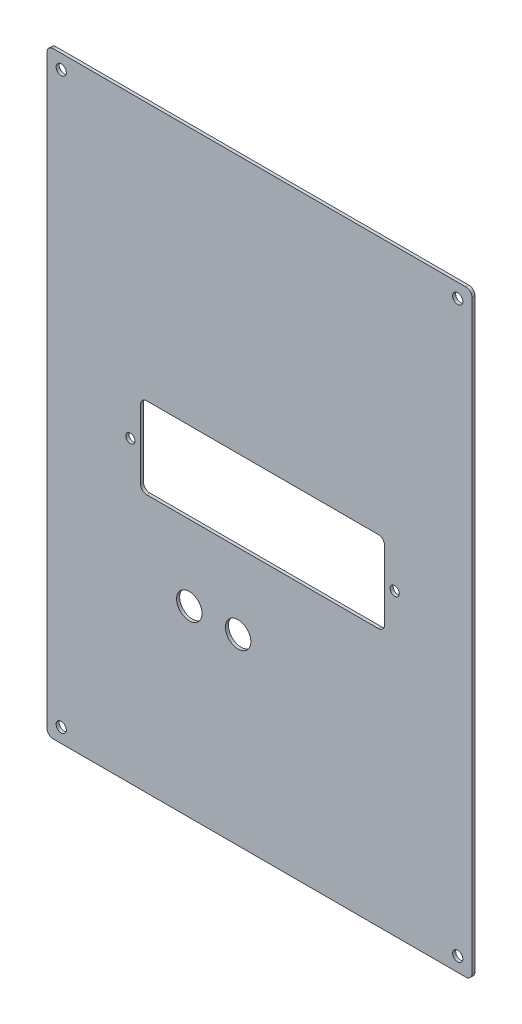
ISO-10303-21;
HEADER;
FILE_DESCRIPTION(('STEP AP214'),'2;1');
FILE_NAME('part.step','',(''),(''),'','','');
FILE_SCHEMA(('AUTOMOTIVE_DESIGN { 1 0 10303 214 1 1 1 1 }'));
ENDSEC;
DATA;
#1=APPLICATION_CONTEXT('core data for automotive mechanical design processes');
#2=APPLICATION_PROTOCOL_DEFINITION('international standard','automotive_design',2000,#1);
#3=PRODUCT_CONTEXT('',#1,'mechanical');
#4=PRODUCT('Part','Part','',(#3));
#5=PRODUCT_RELATED_PRODUCT_CATEGORY('part','',(#4));
#6=PRODUCT_DEFINITION_FORMATION('','',#4);
#7=PRODUCT_DEFINITION_CONTEXT('part definition',#1,'design');
#8=PRODUCT_DEFINITION('design','',#6,#7);
#9=PRODUCT_DEFINITION_SHAPE('','',#8);
#10=(LENGTH_UNIT() NAMED_UNIT(*) SI_UNIT(.MILLI.,.METRE.));
#11=(NAMED_UNIT(*) PLANE_ANGLE_UNIT() SI_UNIT($,.RADIAN.));
#12=(NAMED_UNIT(*) SI_UNIT($,.STERADIAN.) SOLID_ANGLE_UNIT());
#13=UNCERTAINTY_MEASURE_WITH_UNIT(LENGTH_MEASURE(1.E-05),#10,'distance_accuracy_value','');
#14=(GEOMETRIC_REPRESENTATION_CONTEXT(3) GLOBAL_UNCERTAINTY_ASSIGNED_CONTEXT((#13)) GLOBAL_UNIT_ASSIGNED_CONTEXT((#10,
#11,#12)) REPRESENTATION_CONTEXT('',''));
#15=CARTESIAN_POINT('',(0.,0.,0.));
#16=DIRECTION('',(0.,0.,1.));
#17=DIRECTION('',(1.,0.,0.));
#18=AXIS2_PLACEMENT_3D('',#15,#16,#17);
#19=CARTESIAN_POINT('',(206.,291.,1.5));
#20=DIRECTION('',(0.,0.,1.));
#21=DIRECTION('',(1.,0.,0.));
#22=AXIS2_PLACEMENT_3D('',#19,#20,#21);
#23=PLANE('',#22);
#24=CARTESIAN_POINT('',(171.,147.,1.5));
#25=DIRECTION('',(0.,0.,1.));
#26=DIRECTION('',(1.,0.,0.));
#27=AXIS2_PLACEMENT_3D('',#24,#25,#26);
#28=CIRCLE('',#27,2.25000000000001);
#29=CARTESIAN_POINT('',(173.25,147.,1.5));
#30=VERTEX_POINT('',#29);
#31=EDGE_CURVE('E507',#30,#30,#28,.T.);
#32=ORIENTED_EDGE('',*,*,#31,.F.);
#33=EDGE_LOOP('',(#32));
#34=FACE_BOUND('',#33,.T.);
#35=CARTESIAN_POINT('',(40.9999999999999,147.,1.5));
#36=DIRECTION('',(0.,0.,1.));
#37=DIRECTION('',(1.,0.,0.));
#38=AXIS2_PLACEMENT_3D('',#35,#36,#37);
#39=CIRCLE('',#38,2.25);
#40=CARTESIAN_POINT('',(43.2499999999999,147.,1.5));
#41=VERTEX_POINT('',#40);
#42=EDGE_CURVE('E493',#41,#41,#39,.T.);
#43=ORIENTED_EDGE('',*,*,#42,.F.);
#44=EDGE_LOOP('',(#43));
#45=FACE_BOUND('',#44,.T.);
#46=CARTESIAN_POINT('',(163.,130.,1.5));
#47=DIRECTION('',(0.,0.,1.));
#48=DIRECTION('',(1.,0.,0.));
#49=AXIS2_PLACEMENT_3D('',#46,#47,#48);
#50=CIRCLE('',#49,3.);
#51=CARTESIAN_POINT('',(163.,127.,1.5));
#52=VERTEX_POINT('',#51);
#53=CARTESIAN_POINT('',(166.,130.,1.5));
#54=VERTEX_POINT('',#53);
#55=EDGE_CURVE('E54',#52,#54,#50,.T.);
#56=ORIENTED_EDGE('',*,*,#55,.F.);
#57=DIRECTION('',(1.,0.,0.));
#58=VECTOR('',#57,1.);
#59=CARTESIAN_POINT('',(48.9999999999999,127.,1.5));
#60=LINE('',#59,#58);
#61=CARTESIAN_POINT('',(48.9999999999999,127.,1.5));
#62=VERTEX_POINT('',#61);
#63=EDGE_CURVE('E161',#62,#52,#60,.T.);
#64=ORIENTED_EDGE('',*,*,#63,.F.);
#65=CARTESIAN_POINT('',(48.9999999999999,130.,1.5));
#66=DIRECTION('',(0.,0.,1.));
#67=DIRECTION('',(-1.,0.,0.));
#68=AXIS2_PLACEMENT_3D('',#65,#66,#67);
#69=CIRCLE('',#68,3.);
#70=CARTESIAN_POINT('',(45.9999999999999,130.,1.5));
#71=VERTEX_POINT('',#70);
#72=EDGE_CURVE('E205',#71,#62,#69,.T.);
#73=ORIENTED_EDGE('',*,*,#72,.F.);
#74=DIRECTION('',(0.,-1.,0.));
#75=VECTOR('',#74,1.);
#76=CARTESIAN_POINT('',(45.9999999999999,164.,1.5));
#77=LINE('',#76,#75);
#78=CARTESIAN_POINT('',(45.9999999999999,164.,1.5));
#79=VERTEX_POINT('',#78);
#80=EDGE_CURVE('E201',#79,#71,#77,.T.);
#81=ORIENTED_EDGE('',*,*,#80,.F.);
#82=CARTESIAN_POINT('',(48.9999999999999,164.,1.5));
#83=DIRECTION('',(0.,0.,1.));
#84=DIRECTION('',(-1.,0.,0.));
#85=AXIS2_PLACEMENT_3D('',#82,#83,#84);
#86=CIRCLE('',#85,3.);
#87=CARTESIAN_POINT('',(48.9999999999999,167.,1.49999999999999));
#88=VERTEX_POINT('',#87);
#89=EDGE_CURVE('E197',#88,#79,#86,.T.);
#90=ORIENTED_EDGE('',*,*,#89,.F.);
#91=DIRECTION('',(-1.,0.,0.));
#92=VECTOR('',#91,1.);
#93=CARTESIAN_POINT('',(48.9999999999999,167.,1.49999999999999));
#94=LINE('',#93,#92);
#95=CARTESIAN_POINT('',(163.,167.,1.5));
#96=VERTEX_POINT('',#95);
#97=EDGE_CURVE('E193',#96,#88,#94,.T.);
#98=ORIENTED_EDGE('',*,*,#97,.F.);
#99=CARTESIAN_POINT('',(163.,164.,1.5));
#100=DIRECTION('',(0.,0.,1.));
#101=DIRECTION('',(1.,0.,0.));
#102=AXIS2_PLACEMENT_3D('',#99,#100,#101);
#103=CIRCLE('',#102,3.);
#104=CARTESIAN_POINT('',(166.,164.,1.5));
#105=VERTEX_POINT('',#104);
#106=EDGE_CURVE('E189',#105,#96,#103,.T.);
#107=ORIENTED_EDGE('',*,*,#106,.F.);
#108=DIRECTION('',(0.,1.,0.));
#109=VECTOR('',#108,1.);
#110=CARTESIAN_POINT('',(166.,164.,1.5));
#111=LINE('',#110,#109);
#112=EDGE_CURVE('E181',#54,#105,#111,.T.);
#113=ORIENTED_EDGE('',*,*,#112,.F.);
#114=EDGE_LOOP('',(#56,#64,#73,#81,#90,#98,#107,#113));
#115=FACE_BOUND('',#114,.T.);
#116=CARTESIAN_POINT('',(93.9999999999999,90.,1.5));
#117=DIRECTION('',(0.,0.,1.));
#118=DIRECTION('',(1.,0.,0.));
#119=AXIS2_PLACEMENT_3D('',#116,#117,#118);
#120=CIRCLE('',#119,6.25);
#121=CARTESIAN_POINT('',(100.25,90.,1.5));
#122=VERTEX_POINT('',#121);
#123=EDGE_CURVE('E168',#122,#122,#120,.T.);
#124=ORIENTED_EDGE('',*,*,#123,.F.);
#125=EDGE_LOOP('',(#124));
#126=FACE_BOUND('',#125,.T.);
#127=CARTESIAN_POINT('',(70.,90.,1.5));
#128=DIRECTION('',(0.,0.,1.));
#129=DIRECTION('',(1.,0.,0.));
#130=AXIS2_PLACEMENT_3D('',#127,#128,#129);
#131=CIRCLE('',#130,6.25);
#132=CARTESIAN_POINT('',(76.25,90.,1.5));
#133=VERTEX_POINT('',#132);
#134=EDGE_CURVE('E238',#133,#133,#131,.T.);
#135=ORIENTED_EDGE('',*,*,#134,.F.);
#136=EDGE_LOOP('',(#135));
#137=FACE_BOUND('',#136,.T.);
#138=CARTESIAN_POINT('',(202.,7.00000000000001,1.5));
#139=DIRECTION('',(0.,0.,1.));
#140=DIRECTION('',(1.,0.,0.));
#141=AXIS2_PLACEMENT_3D('',#138,#139,#140);
#142=CIRCLE('',#141,2.5);
#143=CARTESIAN_POINT('',(204.5,7.00000000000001,1.5));
#144=VERTEX_POINT('',#143);
#145=EDGE_CURVE('E255',#144,#144,#142,.T.);
#146=ORIENTED_EDGE('',*,*,#145,.F.);
#147=EDGE_LOOP('',(#146));
#148=FACE_BOUND('',#147,.T.);
#149=CARTESIAN_POINT('',(6.9999999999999,287.,1.5));
#150=DIRECTION('',(0.,0.,1.));
#151=DIRECTION('',(1.,0.,0.));
#152=AXIS2_PLACEMENT_3D('',#149,#150,#151);
#153=CIRCLE('',#152,2.5);
#154=CARTESIAN_POINT('',(9.4999999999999,287.,1.5));
#155=VERTEX_POINT('',#154);
#156=EDGE_CURVE('E271',#155,#155,#153,.T.);
#157=ORIENTED_EDGE('',*,*,#156,.F.);
#158=EDGE_LOOP('',(#157));
#159=FACE_BOUND('',#158,.T.);
#160=CARTESIAN_POINT('',(206.,291.,1.5));
#161=DIRECTION('',(0.,0.,1.));
#162=DIRECTION('',(1.,0.,0.));
#163=AXIS2_PLACEMENT_3D('',#160,#161,#162);
#164=CIRCLE('',#163,3.);
#165=CARTESIAN_POINT('',(209.,291.,1.5));
#166=VERTEX_POINT('',#165);
#167=CARTESIAN_POINT('',(206.,294.,1.5));
#168=VERTEX_POINT('',#167);
#169=EDGE_CURVE('E279',#166,#168,#164,.T.);
#170=ORIENTED_EDGE('',*,*,#169,.T.);
#171=DIRECTION('',(-1.,0.,0.));
#172=VECTOR('',#171,1.);
#173=CARTESIAN_POINT('',(2.99999999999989,294.,1.5));
#174=LINE('',#173,#172);
#175=CARTESIAN_POINT('',(2.99999999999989,294.,1.5));
#176=VERTEX_POINT('',#175);
#177=EDGE_CURVE('E283',#168,#176,#174,.T.);
#178=ORIENTED_EDGE('',*,*,#177,.T.);
#179=CARTESIAN_POINT('',(2.99999999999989,291.,1.5));
#180=DIRECTION('',(0.,0.,1.));
#181=DIRECTION('',(-1.,0.,0.));
#182=AXIS2_PLACEMENT_3D('',#179,#180,#181);
#183=CIRCLE('',#182,3.);
#184=CARTESIAN_POINT('',(-1.11022302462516E-13,291.,1.5));
#185=VERTEX_POINT('',#184);
#186=EDGE_CURVE('E286',#176,#185,#183,.T.);
#187=ORIENTED_EDGE('',*,*,#186,.T.);
#188=DIRECTION('',(0.,-1.,0.));
#189=VECTOR('',#188,1.);
#190=CARTESIAN_POINT('',(-1.11022302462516E-13,63.5,1.5));
#191=LINE('',#190,#189);
#192=CARTESIAN_POINT('',(0.,3.,1.5));
#193=VERTEX_POINT('',#192);
#194=EDGE_CURVE('E289',#185,#193,#191,.T.);
#195=ORIENTED_EDGE('',*,*,#194,.T.);
#196=CARTESIAN_POINT('',(3.,3.,1.5));
#197=DIRECTION('',(0.,0.,1.));
#198=DIRECTION('',(-1.,0.,0.));
#199=AXIS2_PLACEMENT_3D('',#196,#197,#198);
#200=CIRCLE('',#199,3.);
#201=CARTESIAN_POINT('',(3.,0.,1.5));
#202=VERTEX_POINT('',#201);
#203=EDGE_CURVE('E292',#193,#202,#200,.T.);
#204=ORIENTED_EDGE('',*,*,#203,.T.);
#205=DIRECTION('',(1.,0.,0.));
#206=VECTOR('',#205,1.);
#207=CARTESIAN_POINT('',(3.,0.,1.5));
#208=LINE('',#207,#206);
#209=CARTESIAN_POINT('',(206.,0.,1.5));
#210=VERTEX_POINT('',#209);
#211=EDGE_CURVE('E295',#202,#210,#208,.T.);
#212=ORIENTED_EDGE('',*,*,#211,.T.);
#213=CARTESIAN_POINT('',(206.,3.,1.5));
#214=DIRECTION('',(0.,0.,1.));
#215=DIRECTION('',(1.,0.,0.));
#216=AXIS2_PLACEMENT_3D('',#213,#214,#215);
#217=CIRCLE('',#216,3.);
#218=CARTESIAN_POINT('',(209.,3.00000000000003,1.5));
#219=VERTEX_POINT('',#218);
#220=EDGE_CURVE('E298',#210,#219,#217,.T.);
#221=ORIENTED_EDGE('',*,*,#220,.T.);
#222=DIRECTION('',(0.,1.,0.));
#223=VECTOR('',#222,1.);
#224=CARTESIAN_POINT('',(209.,3.00000000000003,1.5));
#225=LINE('',#224,#223);
#226=EDGE_CURVE('E301',#219,#166,#225,.T.);
#227=ORIENTED_EDGE('',*,*,#226,.T.);
#228=EDGE_LOOP('',(#170,#178,#187,#195,#204,#212,#221,#227));
#229=FACE_BOUND('',#228,.T.);
#230=CARTESIAN_POINT('',(202.,287.,1.5));
#231=DIRECTION('',(0.,0.,1.));
#232=DIRECTION('',(1.,0.,0.));
#233=AXIS2_PLACEMENT_3D('',#230,#231,#232);
#234=CIRCLE('',#233,2.5);
#235=CARTESIAN_POINT('',(204.5,287.,1.5));
#236=VERTEX_POINT('',#235);
#237=EDGE_CURVE('E263',#236,#236,#234,.T.);
#238=ORIENTED_EDGE('',*,*,#237,.F.);
#239=EDGE_LOOP('',(#238));
#240=FACE_BOUND('',#239,.T.);
#241=CARTESIAN_POINT('',(7.00000000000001,7.00000000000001,1.5));
#242=DIRECTION('',(0.,0.,1.));
#243=DIRECTION('',(1.,0.,0.));
#244=AXIS2_PLACEMENT_3D('',#241,#242,#243);
#245=CIRCLE('',#244,2.5);
#246=CARTESIAN_POINT('',(9.50000000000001,7.00000000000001,1.5));
#247=VERTEX_POINT('',#246);
#248=EDGE_CURVE('E247',#247,#247,#245,.T.);
#249=ORIENTED_EDGE('',*,*,#248,.F.);
#250=EDGE_LOOP('',(#249));
#251=FACE_BOUND('',#250,.T.);
#252=ADVANCED_FACE('F38',(#34,#45,#115,#126,#137,#148,#159,#229,#240,#251),#23,.T.);
#253=CARTESIAN_POINT('',(206.,291.,0.));
#254=DIRECTION('',(0.,0.,1.));
#255=DIRECTION('',(1.,0.,0.));
#256=AXIS2_PLACEMENT_3D('',#253,#254,#255);
#257=PLANE('',#256);
#258=CARTESIAN_POINT('',(171.,147.,0.));
#259=DIRECTION('',(0.,0.,1.));
#260=DIRECTION('',(1.,0.,0.));
#261=AXIS2_PLACEMENT_3D('',#258,#259,#260);
#262=CIRCLE('',#261,2.25000000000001);
#263=CARTESIAN_POINT('',(173.25,147.,0.));
#264=VERTEX_POINT('',#263);
#265=EDGE_CURVE('E504',#264,#264,#262,.F.);
#266=ORIENTED_EDGE('',*,*,#265,.F.);
#267=EDGE_LOOP('',(#266));
#268=FACE_BOUND('',#267,.T.);
#269=CARTESIAN_POINT('',(40.9999999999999,147.,0.));
#270=DIRECTION('',(0.,0.,1.));
#271=DIRECTION('',(1.,0.,0.));
#272=AXIS2_PLACEMENT_3D('',#269,#270,#271);
#273=CIRCLE('',#272,2.25);
#274=CARTESIAN_POINT('',(43.2499999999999,147.,0.));
#275=VERTEX_POINT('',#274);
#276=EDGE_CURVE('E496',#275,#275,#273,.F.);
#277=ORIENTED_EDGE('',*,*,#276,.F.);
#278=EDGE_LOOP('',(#277));
#279=FACE_BOUND('',#278,.T.);
#280=DIRECTION('',(-1.,0.,0.));
#281=VECTOR('',#280,1.);
#282=CARTESIAN_POINT('',(48.9999999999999,127.,0.));
#283=LINE('',#282,#281);
#284=CARTESIAN_POINT('',(163.,127.,0.));
#285=VERTEX_POINT('',#284);
#286=CARTESIAN_POINT('',(48.9999999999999,127.,0.));
#287=VERTEX_POINT('',#286);
#288=EDGE_CURVE('E175',#285,#287,#283,.T.);
#289=ORIENTED_EDGE('',*,*,#288,.F.);
#290=CARTESIAN_POINT('',(163.,130.,0.));
#291=DIRECTION('',(0.,0.,1.));
#292=DIRECTION('',(1.,0.,0.));
#293=AXIS2_PLACEMENT_3D('',#290,#291,#292);
#294=CIRCLE('',#293,3.);
#295=CARTESIAN_POINT('',(166.,130.,0.));
#296=VERTEX_POINT('',#295);
#297=EDGE_CURVE('E154',#296,#285,#294,.F.);
#298=ORIENTED_EDGE('',*,*,#297,.F.);
#299=DIRECTION('',(0.,-1.,0.));
#300=VECTOR('',#299,1.);
#301=CARTESIAN_POINT('',(166.,164.,0.));
#302=LINE('',#301,#300);
#303=CARTESIAN_POINT('',(166.,164.,0.));
#304=VERTEX_POINT('',#303);
#305=EDGE_CURVE('E164',#304,#296,#302,.T.);
#306=ORIENTED_EDGE('',*,*,#305,.F.);
#307=CARTESIAN_POINT('',(163.,164.,0.));
#308=DIRECTION('',(0.,0.,1.));
#309=DIRECTION('',(1.,0.,0.));
#310=AXIS2_PLACEMENT_3D('',#307,#308,#309);
#311=CIRCLE('',#310,3.);
#312=CARTESIAN_POINT('',(163.,167.,0.));
#313=VERTEX_POINT('',#312);
#314=EDGE_CURVE('E62',#313,#304,#311,.F.);
#315=ORIENTED_EDGE('',*,*,#314,.F.);
#316=DIRECTION('',(1.,0.,0.));
#317=VECTOR('',#316,1.);
#318=CARTESIAN_POINT('',(48.9999999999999,167.,0.));
#319=LINE('',#318,#317);
#320=CARTESIAN_POINT('',(48.9999999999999,167.,0.));
#321=VERTEX_POINT('',#320);
#322=EDGE_CURVE('E501',#321,#313,#319,.T.);
#323=ORIENTED_EDGE('',*,*,#322,.F.);
#324=CARTESIAN_POINT('',(48.9999999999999,164.,0.));
#325=DIRECTION('',(0.,0.,1.));
#326=DIRECTION('',(1.,0.,0.));
#327=AXIS2_PLACEMENT_3D('',#324,#325,#326);
#328=CIRCLE('',#327,3.);
#329=CARTESIAN_POINT('',(45.9999999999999,164.,0.));
#330=VERTEX_POINT('',#329);
#331=EDGE_CURVE('E517',#330,#321,#328,.F.);
#332=ORIENTED_EDGE('',*,*,#331,.F.);
#333=DIRECTION('',(0.,1.,0.));
#334=VECTOR('',#333,1.);
#335=CARTESIAN_POINT('',(45.9999999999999,164.,0.));
#336=LINE('',#335,#334);
#337=CARTESIAN_POINT('',(45.9999999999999,130.,0.));
#338=VERTEX_POINT('',#337);
#339=EDGE_CURVE('E521',#338,#330,#336,.T.);
#340=ORIENTED_EDGE('',*,*,#339,.F.);
#341=CARTESIAN_POINT('',(48.9999999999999,130.,0.));
#342=DIRECTION('',(0.,0.,1.));
#343=DIRECTION('',(1.,0.,0.));
#344=AXIS2_PLACEMENT_3D('',#341,#342,#343);
#345=CIRCLE('',#344,3.);
#346=EDGE_CURVE('E184',#287,#338,#345,.F.);
#347=ORIENTED_EDGE('',*,*,#346,.F.);
#348=EDGE_LOOP('',(#289,#298,#306,#315,#323,#332,#340,#347));
#349=FACE_BOUND('',#348,.T.);
#350=CARTESIAN_POINT('',(93.9999999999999,90.,0.));
#351=DIRECTION('',(0.,0.,1.));
#352=DIRECTION('',(1.,0.,0.));
#353=AXIS2_PLACEMENT_3D('',#350,#351,#352);
#354=CIRCLE('',#353,6.25);
#355=CARTESIAN_POINT('',(100.25,90.,0.));
#356=VERTEX_POINT('',#355);
#357=EDGE_CURVE('E234',#356,#356,#354,.F.);
#358=ORIENTED_EDGE('',*,*,#357,.F.);
#359=EDGE_LOOP('',(#358));
#360=FACE_BOUND('',#359,.T.);
#361=CARTESIAN_POINT('',(70.,90.,0.));
#362=DIRECTION('',(0.,0.,1.));
#363=DIRECTION('',(1.,0.,0.));
#364=AXIS2_PLACEMENT_3D('',#361,#362,#363);
#365=CIRCLE('',#364,6.25);
#366=CARTESIAN_POINT('',(76.25,90.,0.));
#367=VERTEX_POINT('',#366);
#368=EDGE_CURVE('E242',#367,#367,#365,.F.);
#369=ORIENTED_EDGE('',*,*,#368,.F.);
#370=EDGE_LOOP('',(#369));
#371=FACE_BOUND('',#370,.T.);
#372=CARTESIAN_POINT('',(206.,291.,0.));
#373=DIRECTION('',(0.,0.,1.));
#374=DIRECTION('',(1.,0.,0.));
#375=AXIS2_PLACEMENT_3D('',#372,#373,#374);
#376=CIRCLE('',#375,3.);
#377=CARTESIAN_POINT('',(209.,291.,0.));
#378=VERTEX_POINT('',#377);
#379=CARTESIAN_POINT('',(206.,294.,0.));
#380=VERTEX_POINT('',#379);
#381=EDGE_CURVE('E275',#378,#380,#376,.T.);
#382=ORIENTED_EDGE('',*,*,#381,.F.);
#383=DIRECTION('',(0.,1.,0.));
#384=VECTOR('',#383,1.);
#385=CARTESIAN_POINT('',(209.,3.00000000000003,0.));
#386=LINE('',#385,#384);
#387=CARTESIAN_POINT('',(209.,3.00000000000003,0.));
#388=VERTEX_POINT('',#387);
#389=EDGE_CURVE('E284',#388,#378,#386,.T.);
#390=ORIENTED_EDGE('',*,*,#389,.F.);
#391=CARTESIAN_POINT('',(206.,3.,0.));
#392=DIRECTION('',(0.,0.,1.));
#393=DIRECTION('',(1.,0.,0.));
#394=AXIS2_PLACEMENT_3D('',#391,#392,#393);
#395=CIRCLE('',#394,3.);
#396=CARTESIAN_POINT('',(206.,0.,0.));
#397=VERTEX_POINT('',#396);
#398=EDGE_CURVE('E324',#397,#388,#395,.T.);
#399=ORIENTED_EDGE('',*,*,#398,.F.);
#400=DIRECTION('',(1.,0.,0.));
#401=VECTOR('',#400,1.);
#402=CARTESIAN_POINT('',(3.,0.,0.));
#403=LINE('',#402,#401);
#404=CARTESIAN_POINT('',(3.,0.,0.));
#405=VERTEX_POINT('',#404);
#406=EDGE_CURVE('E321',#405,#397,#403,.T.);
#407=ORIENTED_EDGE('',*,*,#406,.F.);
#408=CARTESIAN_POINT('',(3.,3.,0.));
#409=DIRECTION('',(0.,0.,1.));
#410=DIRECTION('',(-1.,0.,0.));
#411=AXIS2_PLACEMENT_3D('',#408,#409,#410);
#412=CIRCLE('',#411,3.);
#413=CARTESIAN_POINT('',(0.,3.,0.));
#414=VERTEX_POINT('',#413);
#415=EDGE_CURVE('E318',#414,#405,#412,.T.);
#416=ORIENTED_EDGE('',*,*,#415,.F.);
#417=DIRECTION('',(0.,-1.,0.));
#418=VECTOR('',#417,1.);
#419=CARTESIAN_POINT('',(0.,3.,0.));
#420=LINE('',#419,#418);
#421=CARTESIAN_POINT('',(-1.11022302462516E-13,291.,0.));
#422=VERTEX_POINT('',#421);
#423=EDGE_CURVE('E315',#422,#414,#420,.T.);
#424=ORIENTED_EDGE('',*,*,#423,.F.);
#425=CARTESIAN_POINT('',(2.99999999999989,291.,0.));
#426=DIRECTION('',(0.,0.,1.));
#427=DIRECTION('',(-1.,0.,0.));
#428=AXIS2_PLACEMENT_3D('',#425,#426,#427);
#429=CIRCLE('',#428,3.);
#430=CARTESIAN_POINT('',(2.99999999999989,294.,0.));
#431=VERTEX_POINT('',#430);
#432=EDGE_CURVE('E311',#431,#422,#429,.T.);
#433=ORIENTED_EDGE('',*,*,#432,.F.);
#434=DIRECTION('',(-1.,0.,0.));
#435=VECTOR('',#434,1.);
#436=CARTESIAN_POINT('',(2.99999999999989,294.,0.));
#437=LINE('',#436,#435);
#438=EDGE_CURVE('E308',#380,#431,#437,.T.);
#439=ORIENTED_EDGE('',*,*,#438,.F.);
#440=EDGE_LOOP('',(#382,#390,#399,#407,#416,#424,#433,#439));
#441=FACE_BOUND('',#440,.T.);
#442=CARTESIAN_POINT('',(6.9999999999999,287.,0.));
#443=DIRECTION('',(0.,0.,1.));
#444=DIRECTION('',(1.,0.,0.));
#445=AXIS2_PLACEMENT_3D('',#442,#443,#444);
#446=CIRCLE('',#445,2.5);
#447=CARTESIAN_POINT('',(9.4999999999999,287.,0.));
#448=VERTEX_POINT('',#447);
#449=EDGE_CURVE('E267',#448,#448,#446,.T.);
#450=ORIENTED_EDGE('',*,*,#449,.T.);
#451=EDGE_LOOP('',(#450));
#452=FACE_BOUND('',#451,.T.);
#453=CARTESIAN_POINT('',(202.,287.,0.));
#454=DIRECTION('',(0.,0.,1.));
#455=DIRECTION('',(1.,0.,0.));
#456=AXIS2_PLACEMENT_3D('',#453,#454,#455);
#457=CIRCLE('',#456,2.5);
#458=CARTESIAN_POINT('',(204.5,287.,0.));
#459=VERTEX_POINT('',#458);
#460=EDGE_CURVE('E259',#459,#459,#457,.T.);
#461=ORIENTED_EDGE('',*,*,#460,.T.);
#462=EDGE_LOOP('',(#461));
#463=FACE_BOUND('',#462,.T.);
#464=CARTESIAN_POINT('',(202.,7.00000000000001,0.));
#465=DIRECTION('',(0.,0.,1.));
#466=DIRECTION('',(1.,0.,0.));
#467=AXIS2_PLACEMENT_3D('',#464,#465,#466);
#468=CIRCLE('',#467,2.5);
#469=CARTESIAN_POINT('',(204.5,7.00000000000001,0.));
#470=VERTEX_POINT('',#469);
#471=EDGE_CURVE('E251',#470,#470,#468,.T.);
#472=ORIENTED_EDGE('',*,*,#471,.T.);
#473=EDGE_LOOP('',(#472));
#474=FACE_BOUND('',#473,.T.);
#475=CARTESIAN_POINT('',(7.00000000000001,7.00000000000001,0.));
#476=DIRECTION('',(0.,0.,1.));
#477=DIRECTION('',(1.,0.,0.));
#478=AXIS2_PLACEMENT_3D('',#475,#476,#477);
#479=CIRCLE('',#478,2.5);
#480=CARTESIAN_POINT('',(9.50000000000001,7.00000000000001,0.));
#481=VERTEX_POINT('',#480);
#482=EDGE_CURVE('E246',#481,#481,#479,.T.);
#483=ORIENTED_EDGE('',*,*,#482,.T.);
#484=EDGE_LOOP('',(#483));
#485=FACE_BOUND('',#484,.T.);
#486=ADVANCED_FACE('F171',(#268,#279,#349,#360,#371,#441,#452,#463,#474,#485),#257,.F.);
#487=CARTESIAN_POINT('',(206.,291.,1.5));
#488=DIRECTION('',(0.,0.,-1.));
#489=DIRECTION('',(-1.,0.,0.));
#490=AXIS2_PLACEMENT_3D('',#487,#488,#489);
#491=CYLINDRICAL_SURFACE('',#490,3.);
#492=ORIENTED_EDGE('',*,*,#381,.T.);
#493=DIRECTION('',(0.,0.,-1.));
#494=VECTOR('',#493,1.);
#495=CARTESIAN_POINT('',(206.,294.,1.5));
#496=LINE('',#495,#494);
#497=EDGE_CURVE('E11',#168,#380,#496,.T.);
#498=ORIENTED_EDGE('',*,*,#497,.F.);
#499=ORIENTED_EDGE('',*,*,#169,.F.);
#500=DIRECTION('',(0.,0.,-1.));
#501=VECTOR('',#500,1.);
#502=CARTESIAN_POINT('',(209.,291.,1.5));
#503=LINE('',#502,#501);
#504=EDGE_CURVE('E304',#166,#378,#503,.T.);
#505=ORIENTED_EDGE('',*,*,#504,.T.);
#506=EDGE_LOOP('',(#492,#498,#499,#505));
#507=FACE_BOUND('',#506,.T.);
#508=ADVANCED_FACE('F40',(#507),#491,.T.);
#509=CARTESIAN_POINT('',(2.99999999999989,294.,1.5));
#510=DIRECTION('',(0.,-1.,0.));
#511=DIRECTION('',(0.,0.,-1.));
#512=AXIS2_PLACEMENT_3D('',#509,#510,#511);
#513=PLANE('',#512);
#514=ORIENTED_EDGE('',*,*,#438,.T.);
#515=DIRECTION('',(0.,0.,-1.));
#516=VECTOR('',#515,1.);
#517=CARTESIAN_POINT('',(2.99999999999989,294.,1.5));
#518=LINE('',#517,#516);
#519=EDGE_CURVE('E47',#176,#431,#518,.T.);
#520=ORIENTED_EDGE('',*,*,#519,.F.);
#521=ORIENTED_EDGE('',*,*,#177,.F.);
#522=ORIENTED_EDGE('',*,*,#497,.T.);
#523=EDGE_LOOP('',(#514,#520,#521,#522));
#524=FACE_BOUND('',#523,.T.);
#525=ADVANCED_FACE('F379',(#524),#513,.F.);
#526=CARTESIAN_POINT('',(2.99999999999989,291.,1.5));
#527=DIRECTION('',(0.,0.,-1.));
#528=DIRECTION('',(-1.,0.,0.));
#529=AXIS2_PLACEMENT_3D('',#526,#527,#528);
#530=CYLINDRICAL_SURFACE('',#529,3.);
#531=ORIENTED_EDGE('',*,*,#432,.T.);
#532=DIRECTION('',(0.,0.,-1.));
#533=VECTOR('',#532,1.);
#534=CARTESIAN_POINT('',(-1.11022302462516E-13,291.,1.5));
#535=LINE('',#534,#533);
#536=EDGE_CURVE('E348',#185,#422,#535,.T.);
#537=ORIENTED_EDGE('',*,*,#536,.F.);
#538=ORIENTED_EDGE('',*,*,#186,.F.);
#539=ORIENTED_EDGE('',*,*,#519,.T.);
#540=EDGE_LOOP('',(#531,#537,#538,#539));
#541=FACE_BOUND('',#540,.T.);
#542=ADVANCED_FACE('F357',(#541),#530,.T.);
#543=CARTESIAN_POINT('',(0.,3.,1.5));
#544=DIRECTION('',(1.,0.,0.));
#545=DIRECTION('',(0.,0.,-1.));
#546=AXIS2_PLACEMENT_3D('',#543,#544,#545);
#547=PLANE('',#546);
#548=ORIENTED_EDGE('',*,*,#423,.T.);
#549=DIRECTION('',(0.,0.,-1.));
#550=VECTOR('',#549,1.);
#551=CARTESIAN_POINT('',(0.,3.,1.5));
#552=LINE('',#551,#550);
#553=EDGE_CURVE('E344',#193,#414,#552,.T.);
#554=ORIENTED_EDGE('',*,*,#553,.F.);
#555=ORIENTED_EDGE('',*,*,#194,.F.);
#556=ORIENTED_EDGE('',*,*,#536,.T.);
#557=EDGE_LOOP('',(#548,#554,#555,#556));
#558=FACE_BOUND('',#557,.T.);
#559=ADVANCED_FACE('F367',(#558),#547,.F.);
#560=CARTESIAN_POINT('',(3.,3.,1.5));
#561=DIRECTION('',(0.,0.,-1.));
#562=DIRECTION('',(-1.,0.,0.));
#563=AXIS2_PLACEMENT_3D('',#560,#561,#562);
#564=CYLINDRICAL_SURFACE('',#563,3.);
#565=ORIENTED_EDGE('',*,*,#415,.T.);
#566=DIRECTION('',(0.,0.,-1.));
#567=VECTOR('',#566,1.);
#568=CARTESIAN_POINT('',(3.,0.,1.5));
#569=LINE('',#568,#567);
#570=EDGE_CURVE('E340',#202,#405,#569,.T.);
#571=ORIENTED_EDGE('',*,*,#570,.F.);
#572=ORIENTED_EDGE('',*,*,#203,.F.);
#573=ORIENTED_EDGE('',*,*,#553,.T.);
#574=EDGE_LOOP('',(#565,#571,#572,#573));
#575=FACE_BOUND('',#574,.T.);
#576=ADVANCED_FACE('F371',(#575),#564,.T.);
#577=CARTESIAN_POINT('',(3.,0.,1.5));
#578=DIRECTION('',(0.,1.,0.));
#579=DIRECTION('',(0.,0.,1.));
#580=AXIS2_PLACEMENT_3D('',#577,#578,#579);
#581=PLANE('',#580);
#582=ORIENTED_EDGE('',*,*,#406,.T.);
#583=DIRECTION('',(0.,0.,-1.));
#584=VECTOR('',#583,1.);
#585=CARTESIAN_POINT('',(206.,0.,1.5));
#586=LINE('',#585,#584);
#587=EDGE_CURVE('E336',#210,#397,#586,.T.);
#588=ORIENTED_EDGE('',*,*,#587,.F.);
#589=ORIENTED_EDGE('',*,*,#211,.F.);
#590=ORIENTED_EDGE('',*,*,#570,.T.);
#591=EDGE_LOOP('',(#582,#588,#589,#590));
#592=FACE_BOUND('',#591,.T.);
#593=ADVANCED_FACE('F392',(#592),#581,.F.);
#594=CARTESIAN_POINT('',(206.,3.,1.5));
#595=DIRECTION('',(0.,0.,-1.));
#596=DIRECTION('',(-1.,0.,0.));
#597=AXIS2_PLACEMENT_3D('',#594,#595,#596);
#598=CYLINDRICAL_SURFACE('',#597,3.);
#599=ORIENTED_EDGE('',*,*,#398,.T.);
#600=DIRECTION('',(0.,0.,-1.));
#601=VECTOR('',#600,1.);
#602=CARTESIAN_POINT('',(209.,3.00000000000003,1.5));
#603=LINE('',#602,#601);
#604=EDGE_CURVE('E332',#219,#388,#603,.T.);
#605=ORIENTED_EDGE('',*,*,#604,.F.);
#606=ORIENTED_EDGE('',*,*,#220,.F.);
#607=ORIENTED_EDGE('',*,*,#587,.T.);
#608=EDGE_LOOP('',(#599,#605,#606,#607));
#609=FACE_BOUND('',#608,.T.);
#610=ADVANCED_FACE('F390',(#609),#598,.T.);
#611=CARTESIAN_POINT('',(209.,3.00000000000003,1.5));
#612=DIRECTION('',(-1.,0.,0.));
#613=DIRECTION('',(0.,0.,1.));
#614=AXIS2_PLACEMENT_3D('',#611,#612,#613);
#615=PLANE('',#614);
#616=ORIENTED_EDGE('',*,*,#389,.T.);
#617=ORIENTED_EDGE('',*,*,#504,.F.);
#618=ORIENTED_EDGE('',*,*,#226,.F.);
#619=ORIENTED_EDGE('',*,*,#604,.T.);
#620=EDGE_LOOP('',(#616,#617,#618,#619));
#621=FACE_BOUND('',#620,.T.);
#622=ADVANCED_FACE('F385',(#621),#615,.F.);
#623=CARTESIAN_POINT('',(6.9999999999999,287.,1.5));
#624=DIRECTION('',(0.,0.,-1.));
#625=DIRECTION('',(-1.,0.,0.));
#626=AXIS2_PLACEMENT_3D('',#623,#624,#625);
#627=CYLINDRICAL_SURFACE('',#626,2.5);
#628=ORIENTED_EDGE('',*,*,#156,.T.);
#629=EDGE_LOOP('',(#628));
#630=FACE_BOUND('',#629,.T.);
#631=ORIENTED_EDGE('',*,*,#449,.F.);
#632=EDGE_LOOP('',(#631));
#633=FACE_BOUND('',#632,.T.);
#634=ADVANCED_FACE('F412',(#630,#633),#627,.F.);
#635=CARTESIAN_POINT('',(202.,287.,1.5));
#636=DIRECTION('',(0.,0.,-1.));
#637=DIRECTION('',(-1.,0.,0.));
#638=AXIS2_PLACEMENT_3D('',#635,#636,#637);
#639=CYLINDRICAL_SURFACE('',#638,2.5);
#640=ORIENTED_EDGE('',*,*,#237,.T.);
#641=EDGE_LOOP('',(#640));
#642=FACE_BOUND('',#641,.T.);
#643=ORIENTED_EDGE('',*,*,#460,.F.);
#644=EDGE_LOOP('',(#643));
#645=FACE_BOUND('',#644,.T.);
#646=ADVANCED_FACE('F419',(#642,#645),#639,.F.);
#647=CARTESIAN_POINT('',(202.,7.00000000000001,1.5));
#648=DIRECTION('',(0.,0.,-1.));
#649=DIRECTION('',(-1.,0.,0.));
#650=AXIS2_PLACEMENT_3D('',#647,#648,#649);
#651=CYLINDRICAL_SURFACE('',#650,2.5);
#652=ORIENTED_EDGE('',*,*,#145,.T.);
#653=EDGE_LOOP('',(#652));
#654=FACE_BOUND('',#653,.T.);
#655=ORIENTED_EDGE('',*,*,#471,.F.);
#656=EDGE_LOOP('',(#655));
#657=FACE_BOUND('',#656,.T.);
#658=ADVANCED_FACE('F424',(#654,#657),#651,.F.);
#659=CARTESIAN_POINT('',(7.00000000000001,7.00000000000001,1.5));
#660=DIRECTION('',(0.,0.,-1.));
#661=DIRECTION('',(-1.,0.,0.));
#662=AXIS2_PLACEMENT_3D('',#659,#660,#661);
#663=CYLINDRICAL_SURFACE('',#662,2.5);
#664=ORIENTED_EDGE('',*,*,#248,.T.);
#665=EDGE_LOOP('',(#664));
#666=FACE_BOUND('',#665,.T.);
#667=ORIENTED_EDGE('',*,*,#482,.F.);
#668=EDGE_LOOP('',(#667));
#669=FACE_BOUND('',#668,.T.);
#670=ADVANCED_FACE('F436',(#666,#669),#663,.F.);
#671=CARTESIAN_POINT('',(70.,90.,-0.001000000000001));
#672=DIRECTION('',(0.,0.,1.));
#673=DIRECTION('',(1.,0.,0.));
#674=AXIS2_PLACEMENT_3D('',#671,#672,#673);
#675=CYLINDRICAL_SURFACE('',#674,6.25);
#676=ORIENTED_EDGE('',*,*,#134,.T.);
#677=EDGE_LOOP('',(#676));
#678=FACE_BOUND('',#677,.T.);
#679=ORIENTED_EDGE('',*,*,#368,.T.);
#680=EDGE_LOOP('',(#679));
#681=FACE_BOUND('',#680,.T.);
#682=ADVANCED_FACE('F438',(#678,#681),#675,.F.);
#683=CARTESIAN_POINT('',(93.9999999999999,90.,-0.001000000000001));
#684=DIRECTION('',(0.,0.,1.));
#685=DIRECTION('',(1.,0.,0.));
#686=AXIS2_PLACEMENT_3D('',#683,#684,#685);
#687=CYLINDRICAL_SURFACE('',#686,6.25);
#688=ORIENTED_EDGE('',*,*,#123,.T.);
#689=EDGE_LOOP('',(#688));
#690=FACE_BOUND('',#689,.T.);
#691=ORIENTED_EDGE('',*,*,#357,.T.);
#692=EDGE_LOOP('',(#691));
#693=FACE_BOUND('',#692,.T.);
#694=ADVANCED_FACE('F445',(#690,#693),#687,.F.);
#695=CARTESIAN_POINT('',(163.,130.,-0.001000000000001));
#696=DIRECTION('',(0.,0.,1.));
#697=DIRECTION('',(1.,0.,0.));
#698=AXIS2_PLACEMENT_3D('',#695,#696,#697);
#699=CYLINDRICAL_SURFACE('',#698,3.);
#700=ORIENTED_EDGE('',*,*,#297,.T.);
#701=DIRECTION('',(0.,0.,1.));
#702=VECTOR('',#701,1.);
#703=CARTESIAN_POINT('',(163.,127.,-0.001000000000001));
#704=LINE('',#703,#702);
#705=EDGE_CURVE('E169',#285,#52,#704,.T.);
#706=ORIENTED_EDGE('',*,*,#705,.T.);
#707=ORIENTED_EDGE('',*,*,#55,.T.);
#708=DIRECTION('',(0.,0.,1.));
#709=VECTOR('',#708,1.);
#710=CARTESIAN_POINT('',(166.,130.,-0.001000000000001));
#711=LINE('',#710,#709);
#712=EDGE_CURVE('E150',#296,#54,#711,.T.);
#713=ORIENTED_EDGE('',*,*,#712,.F.);
#714=EDGE_LOOP('',(#700,#706,#707,#713));
#715=FACE_BOUND('',#714,.T.);
#716=ADVANCED_FACE('F152',(#715),#699,.F.);
#717=CARTESIAN_POINT('',(48.9999999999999,127.,-0.001000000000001));
#718=DIRECTION('',(0.,-1.,0.));
#719=DIRECTION('',(0.,0.,-1.));
#720=AXIS2_PLACEMENT_3D('',#717,#718,#719);
#721=PLANE('',#720);
#722=ORIENTED_EDGE('',*,*,#288,.T.);
#723=DIRECTION('',(0.,0.,1.));
#724=VECTOR('',#723,1.);
#725=CARTESIAN_POINT('',(48.9999999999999,127.,-0.001000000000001));
#726=LINE('',#725,#724);
#727=EDGE_CURVE('E214',#287,#62,#726,.T.);
#728=ORIENTED_EDGE('',*,*,#727,.T.);
#729=ORIENTED_EDGE('',*,*,#63,.T.);
#730=ORIENTED_EDGE('',*,*,#705,.F.);
#731=EDGE_LOOP('',(#722,#728,#729,#730));
#732=FACE_BOUND('',#731,.T.);
#733=ADVANCED_FACE('F456',(#732),#721,.F.);
#734=CARTESIAN_POINT('',(48.9999999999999,130.,-0.001000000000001));
#735=DIRECTION('',(0.,0.,1.));
#736=DIRECTION('',(1.,0.,0.));
#737=AXIS2_PLACEMENT_3D('',#734,#735,#736);
#738=CYLINDRICAL_SURFACE('',#737,3.);
#739=ORIENTED_EDGE('',*,*,#346,.T.);
#740=DIRECTION('',(0.,0.,1.));
#741=VECTOR('',#740,1.);
#742=CARTESIAN_POINT('',(45.9999999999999,130.,-0.001000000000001));
#743=LINE('',#742,#741);
#744=EDGE_CURVE('E217',#338,#71,#743,.T.);
#745=ORIENTED_EDGE('',*,*,#744,.T.);
#746=ORIENTED_EDGE('',*,*,#72,.T.);
#747=ORIENTED_EDGE('',*,*,#727,.F.);
#748=EDGE_LOOP('',(#739,#745,#746,#747));
#749=FACE_BOUND('',#748,.T.);
#750=ADVANCED_FACE('F474',(#749),#738,.F.);
#751=CARTESIAN_POINT('',(45.9999999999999,164.,-0.000999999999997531));
#752=DIRECTION('',(-1.,0.,0.));
#753=DIRECTION('',(0.,0.,1.));
#754=AXIS2_PLACEMENT_3D('',#751,#752,#753);
#755=PLANE('',#754);
#756=ORIENTED_EDGE('',*,*,#339,.T.);
#757=DIRECTION('',(0.,0.,1.));
#758=VECTOR('',#757,1.);
#759=CARTESIAN_POINT('',(45.9999999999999,164.,-0.000999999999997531));
#760=LINE('',#759,#758);
#761=EDGE_CURVE('E220',#330,#79,#760,.T.);
#762=ORIENTED_EDGE('',*,*,#761,.T.);
#763=ORIENTED_EDGE('',*,*,#80,.T.);
#764=ORIENTED_EDGE('',*,*,#744,.F.);
#765=EDGE_LOOP('',(#756,#762,#763,#764));
#766=FACE_BOUND('',#765,.T.);
#767=ADVANCED_FACE('F470',(#766),#755,.F.);
#768=CARTESIAN_POINT('',(48.9999999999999,164.,-0.000999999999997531));
#769=DIRECTION('',(0.,0.,1.));
#770=DIRECTION('',(1.,0.,0.));
#771=AXIS2_PLACEMENT_3D('',#768,#769,#770);
#772=CYLINDRICAL_SURFACE('',#771,3.);
#773=ORIENTED_EDGE('',*,*,#331,.T.);
#774=DIRECTION('',(0.,0.,1.));
#775=VECTOR('',#774,1.);
#776=CARTESIAN_POINT('',(48.9999999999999,167.,-0.000999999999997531));
#777=LINE('',#776,#775);
#778=EDGE_CURVE('E223',#321,#88,#777,.T.);
#779=ORIENTED_EDGE('',*,*,#778,.T.);
#780=ORIENTED_EDGE('',*,*,#89,.T.);
#781=ORIENTED_EDGE('',*,*,#761,.F.);
#782=EDGE_LOOP('',(#773,#779,#780,#781));
#783=FACE_BOUND('',#782,.T.);
#784=ADVANCED_FACE('F466',(#783),#772,.F.);
#785=CARTESIAN_POINT('',(48.9999999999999,167.,-0.000999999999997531));
#786=DIRECTION('',(0.,1.,0.));
#787=DIRECTION('',(0.,0.,1.));
#788=AXIS2_PLACEMENT_3D('',#785,#786,#787);
#789=PLANE('',#788);
#790=ORIENTED_EDGE('',*,*,#322,.T.);
#791=DIRECTION('',(0.,0.,1.));
#792=VECTOR('',#791,1.);
#793=CARTESIAN_POINT('',(163.,167.,-0.000999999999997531));
#794=LINE('',#793,#792);
#795=EDGE_CURVE('E226',#313,#96,#794,.T.);
#796=ORIENTED_EDGE('',*,*,#795,.T.);
#797=ORIENTED_EDGE('',*,*,#97,.T.);
#798=ORIENTED_EDGE('',*,*,#778,.F.);
#799=EDGE_LOOP('',(#790,#796,#797,#798));
#800=FACE_BOUND('',#799,.T.);
#801=ADVANCED_FACE('F463',(#800),#789,.F.);
#802=CARTESIAN_POINT('',(163.,164.,-0.000999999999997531));
#803=DIRECTION('',(0.,0.,1.));
#804=DIRECTION('',(1.,0.,0.));
#805=AXIS2_PLACEMENT_3D('',#802,#803,#804);
#806=CYLINDRICAL_SURFACE('',#805,3.);
#807=ORIENTED_EDGE('',*,*,#314,.T.);
#808=DIRECTION('',(0.,0.,1.));
#809=VECTOR('',#808,1.);
#810=CARTESIAN_POINT('',(166.,164.,-0.000999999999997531));
#811=LINE('',#810,#809);
#812=EDGE_CURVE('E160',#304,#105,#811,.T.);
#813=ORIENTED_EDGE('',*,*,#812,.T.);
#814=ORIENTED_EDGE('',*,*,#106,.T.);
#815=ORIENTED_EDGE('',*,*,#795,.F.);
#816=EDGE_LOOP('',(#807,#813,#814,#815));
#817=FACE_BOUND('',#816,.T.);
#818=ADVANCED_FACE('F460',(#817),#806,.F.);
#819=CARTESIAN_POINT('',(166.,164.,-0.000999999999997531));
#820=DIRECTION('',(1.,0.,0.));
#821=DIRECTION('',(0.,0.,-1.));
#822=AXIS2_PLACEMENT_3D('',#819,#820,#821);
#823=PLANE('',#822);
#824=ORIENTED_EDGE('',*,*,#305,.T.);
#825=ORIENTED_EDGE('',*,*,#712,.T.);
#826=ORIENTED_EDGE('',*,*,#112,.T.);
#827=ORIENTED_EDGE('',*,*,#812,.F.);
#828=EDGE_LOOP('',(#824,#825,#826,#827));
#829=FACE_BOUND('',#828,.T.);
#830=ADVANCED_FACE('F165',(#829),#823,.F.);
#831=CARTESIAN_POINT('',(40.9999999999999,147.,-0.001000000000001));
#832=DIRECTION('',(0.,0.,1.));
#833=DIRECTION('',(1.,0.,0.));
#834=AXIS2_PLACEMENT_3D('',#831,#832,#833);
#835=CYLINDRICAL_SURFACE('',#834,2.25);
#836=ORIENTED_EDGE('',*,*,#42,.T.);
#837=EDGE_LOOP('',(#836));
#838=FACE_BOUND('',#837,.T.);
#839=ORIENTED_EDGE('',*,*,#276,.T.);
#840=EDGE_LOOP('',(#839));
#841=FACE_BOUND('',#840,.T.);
#842=ADVANCED_FACE('F459',(#838,#841),#835,.F.);
#843=CARTESIAN_POINT('',(171.,147.,-0.001000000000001));
#844=DIRECTION('',(0.,0.,1.));
#845=DIRECTION('',(1.,0.,0.));
#846=AXIS2_PLACEMENT_3D('',#843,#844,#845);
#847=CYLINDRICAL_SURFACE('',#846,2.25000000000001);
#848=ORIENTED_EDGE('',*,*,#31,.T.);
#849=EDGE_LOOP('',(#848));
#850=FACE_BOUND('',#849,.T.);
#851=ORIENTED_EDGE('',*,*,#265,.T.);
#852=EDGE_LOOP('',(#851));
#853=FACE_BOUND('',#852,.T.);
#854=ADVANCED_FACE('F482',(#850,#853),#847,.F.);
#855=CLOSED_SHELL('',(#252,#486,#508,#525,#542,#559,#576,#593,#610,#622,#634,#646,#658,#670,
#682,#694,#716,#733,#750,#767,#784,#801,#818,#830,#842,#854));
#856=MANIFOLD_SOLID_BREP('B2',#855);
#857=ADVANCED_BREP_SHAPE_REPRESENTATION('',(#18,#856),#14);
#858=SHAPE_DEFINITION_REPRESENTATION(#9,#857);
ENDSEC;
END-ISO-10303-21;
